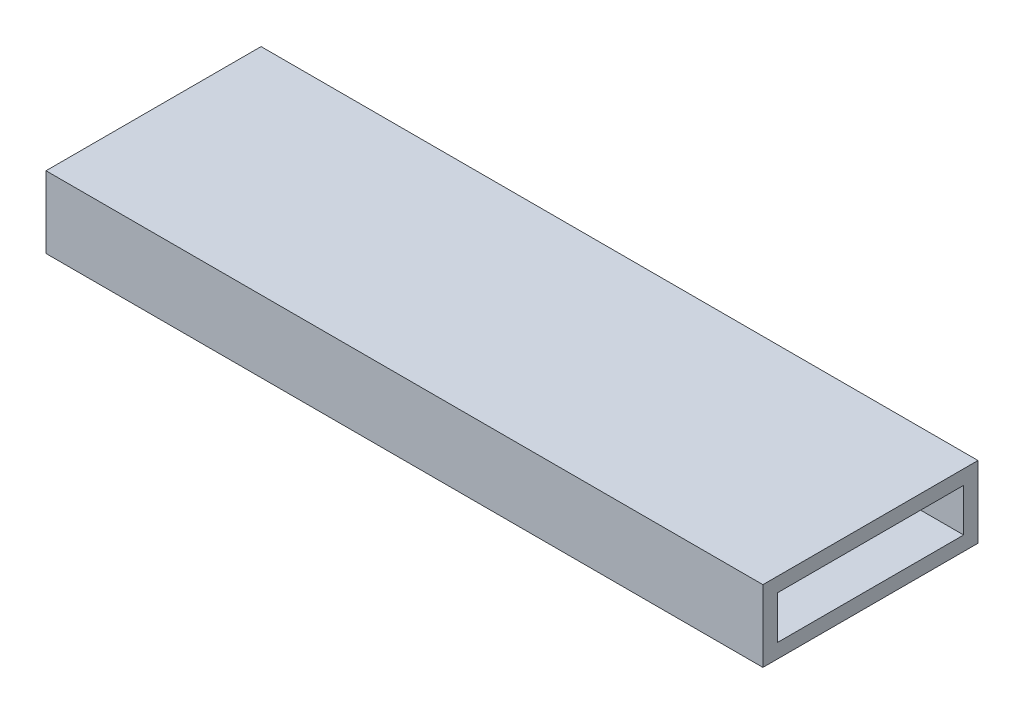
from build123d import *

# Parameters (mm, degrees)
SKETCH1_W           = 30
SKETCH1_H           = 10
BOSS_EXTRUDE1_DEPTH = 100
SKETCH2_W           = 26
SKETCH2_H           = 6
CUT_EXTRUDE1_DEPTH  = 105.880884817


with BuildPart() as part:
    # Sketch1 → Boss-Extrude1 (new body)
    with BuildSketch(Plane(origin=(0, 0, 0), x_dir=(0, 0, -1), z_dir=(1, 0, 0))):
        with Locations((15, 5)):
            Rectangle(SKETCH1_W, SKETCH1_H)
    extrude(amount=BOSS_EXTRUDE1_DEPTH)

    # Sketch2 → Cut-Extrude1 (cut, through all)
    with BuildSketch(Plane.ZY):
        with Locations((-15, 5)):
            Rectangle(SKETCH2_W, SKETCH2_H)
    extrude(amount=-CUT_EXTRUDE1_DEPTH, mode=Mode.SUBTRACT)


solid = part.part
